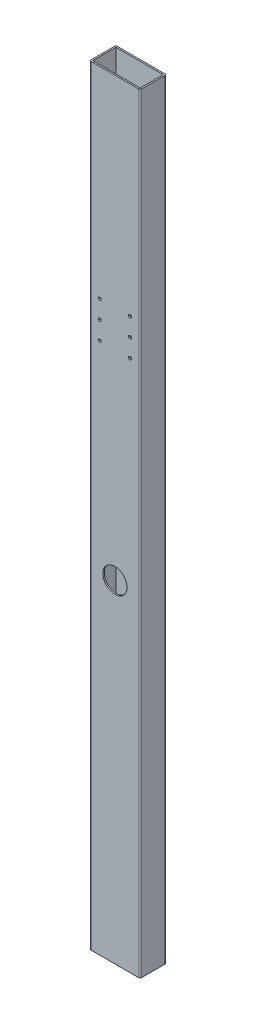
ISO-10303-21;
HEADER;
FILE_DESCRIPTION(('STEP AP214'),'2;1');
FILE_NAME('part.step','',(''),(''),'','','');
FILE_SCHEMA(('AUTOMOTIVE_DESIGN { 1 0 10303 214 1 1 1 1 }'));
ENDSEC;
DATA;
#1=APPLICATION_CONTEXT('core data for automotive mechanical design processes');
#2=APPLICATION_PROTOCOL_DEFINITION('international standard','automotive_design',2000,#1);
#3=PRODUCT_CONTEXT('',#1,'mechanical');
#4=PRODUCT('Part','Part','',(#3));
#5=PRODUCT_RELATED_PRODUCT_CATEGORY('part','',(#4));
#6=PRODUCT_DEFINITION_FORMATION('','',#4);
#7=PRODUCT_DEFINITION_CONTEXT('part definition',#1,'design');
#8=PRODUCT_DEFINITION('design','',#6,#7);
#9=PRODUCT_DEFINITION_SHAPE('','',#8);
#10=(LENGTH_UNIT() NAMED_UNIT(*) SI_UNIT(.MILLI.,.METRE.));
#11=(NAMED_UNIT(*) PLANE_ANGLE_UNIT() SI_UNIT($,.RADIAN.));
#12=(NAMED_UNIT(*) SI_UNIT($,.STERADIAN.) SOLID_ANGLE_UNIT());
#13=UNCERTAINTY_MEASURE_WITH_UNIT(LENGTH_MEASURE(1.E-05),#10,'distance_accuracy_value','');
#14=(GEOMETRIC_REPRESENTATION_CONTEXT(3) GLOBAL_UNCERTAINTY_ASSIGNED_CONTEXT((#13)) GLOBAL_UNIT_ASSIGNED_CONTEXT((#10,
#11,#12)) REPRESENTATION_CONTEXT('',''));
#15=CARTESIAN_POINT('',(0.,0.,0.));
#16=DIRECTION('',(0.,0.,1.));
#17=DIRECTION('',(1.,0.,0.));
#18=AXIS2_PLACEMENT_3D('',#15,#16,#17);
#19=CARTESIAN_POINT('',(-24.8285,0.,12.1285));
#20=DIRECTION('',(0.,1.,0.));
#21=DIRECTION('',(0.,0.,1.));
#22=AXIS2_PLACEMENT_3D('',#19,#20,#21);
#23=PLANE('',#22);
#24=CARTESIAN_POINT('',(-24.8285,0.,12.1285));
#25=DIRECTION('',(0.,1.,0.));
#26=DIRECTION('',(0.,0.,-1.));
#27=AXIS2_PLACEMENT_3D('',#24,#25,#26);
#28=CIRCLE('',#27,1.5875);
#29=CARTESIAN_POINT('',(-26.416,0.,12.1285));
#30=VERTEX_POINT('',#29);
#31=CARTESIAN_POINT('',(-24.8285,0.,13.716));
#32=VERTEX_POINT('',#31);
#33=EDGE_CURVE('E183',#30,#32,#28,.T.);
#34=ORIENTED_EDGE('',*,*,#33,.F.);
#35=DIRECTION('',(0.,0.,1.));
#36=VECTOR('',#35,1.);
#37=CARTESIAN_POINT('',(-26.416,0.,12.1285));
#38=LINE('',#37,#36);
#39=CARTESIAN_POINT('',(-26.416,0.,-12.1285));
#40=VERTEX_POINT('',#39);
#41=EDGE_CURVE('E107',#40,#30,#38,.T.);
#42=ORIENTED_EDGE('',*,*,#41,.F.);
#43=CARTESIAN_POINT('',(-24.8285,0.,-12.1285));
#44=DIRECTION('',(0.,1.,0.));
#45=DIRECTION('',(0.,0.,-1.));
#46=AXIS2_PLACEMENT_3D('',#43,#44,#45);
#47=CIRCLE('',#46,1.5875);
#48=CARTESIAN_POINT('',(-24.8285,0.,-13.716));
#49=VERTEX_POINT('',#48);
#50=EDGE_CURVE('E290',#49,#40,#47,.T.);
#51=ORIENTED_EDGE('',*,*,#50,.F.);
#52=DIRECTION('',(-1.,0.,0.));
#53=VECTOR('',#52,1.);
#54=CARTESIAN_POINT('',(-24.8285,0.,-13.716));
#55=LINE('',#54,#53);
#56=CARTESIAN_POINT('',(24.8285,0.,-13.716));
#57=VERTEX_POINT('',#56);
#58=EDGE_CURVE('E287',#57,#49,#55,.T.);
#59=ORIENTED_EDGE('',*,*,#58,.F.);
#60=CARTESIAN_POINT('',(24.8285,0.,-12.1285));
#61=DIRECTION('',(0.,1.,0.));
#62=DIRECTION('',(0.,0.,-1.));
#63=AXIS2_PLACEMENT_3D('',#60,#61,#62);
#64=CIRCLE('',#63,1.5875);
#65=CARTESIAN_POINT('',(26.416,0.,-12.1285));
#66=VERTEX_POINT('',#65);
#67=EDGE_CURVE('E284',#66,#57,#64,.T.);
#68=ORIENTED_EDGE('',*,*,#67,.F.);
#69=DIRECTION('',(0.,0.,-1.));
#70=VECTOR('',#69,1.);
#71=CARTESIAN_POINT('',(26.416,0.,12.1285));
#72=LINE('',#71,#70);
#73=CARTESIAN_POINT('',(26.416,0.,12.1285));
#74=VERTEX_POINT('',#73);
#75=EDGE_CURVE('E281',#74,#66,#72,.T.);
#76=ORIENTED_EDGE('',*,*,#75,.F.);
#77=CARTESIAN_POINT('',(24.8285,0.,12.1285));
#78=DIRECTION('',(0.,1.,0.));
#79=DIRECTION('',(0.,0.,1.));
#80=AXIS2_PLACEMENT_3D('',#77,#78,#79);
#81=CIRCLE('',#80,1.5875);
#82=CARTESIAN_POINT('',(24.8285,0.,13.716));
#83=VERTEX_POINT('',#82);
#84=EDGE_CURVE('E278',#83,#74,#81,.T.);
#85=ORIENTED_EDGE('',*,*,#84,.F.);
#86=DIRECTION('',(1.,0.,0.));
#87=VECTOR('',#86,1.);
#88=CARTESIAN_POINT('',(-24.8285,0.,13.716));
#89=LINE('',#88,#87);
#90=EDGE_CURVE('E275',#32,#83,#89,.T.);
#91=ORIENTED_EDGE('',*,*,#90,.F.);
#92=EDGE_LOOP('',(#34,#42,#51,#59,#68,#76,#85,#91));
#93=FACE_BOUND('',#92,.T.);
#94=DIRECTION('',(0.,0.,1.));
#95=VECTOR('',#94,1.);
#96=CARTESIAN_POINT('',(-24.8285,0.,12.1285));
#97=LINE('',#96,#95);
#98=CARTESIAN_POINT('',(-24.8285,0.,-12.1285));
#99=VERTEX_POINT('',#98);
#100=CARTESIAN_POINT('',(-24.8285,0.,12.1285));
#101=VERTEX_POINT('',#100);
#102=EDGE_CURVE('E99',#99,#101,#97,.T.);
#103=ORIENTED_EDGE('',*,*,#102,.T.);
#104=DIRECTION('',(1.,0.,0.));
#105=VECTOR('',#104,1.);
#106=CARTESIAN_POINT('',(-24.8285,0.,12.1285));
#107=LINE('',#106,#105);
#108=CARTESIAN_POINT('',(24.8285,0.,12.1285));
#109=VERTEX_POINT('',#108);
#110=EDGE_CURVE('E181',#101,#109,#107,.T.);
#111=ORIENTED_EDGE('',*,*,#110,.T.);
#112=DIRECTION('',(0.,0.,-1.));
#113=VECTOR('',#112,1.);
#114=CARTESIAN_POINT('',(24.8285,0.,12.1285));
#115=LINE('',#114,#113);
#116=CARTESIAN_POINT('',(24.8285,0.,-12.1285));
#117=VERTEX_POINT('',#116);
#118=EDGE_CURVE('E257',#109,#117,#115,.T.);
#119=ORIENTED_EDGE('',*,*,#118,.T.);
#120=DIRECTION('',(-1.,0.,0.));
#121=VECTOR('',#120,1.);
#122=CARTESIAN_POINT('',(-24.8285,0.,-12.1285));
#123=LINE('',#122,#121);
#124=EDGE_CURVE('E261',#117,#99,#123,.T.);
#125=ORIENTED_EDGE('',*,*,#124,.T.);
#126=EDGE_LOOP('',(#103,#111,#119,#125));
#127=FACE_BOUND('',#126,.T.);
#128=ADVANCED_FACE('F81',(#93,#127),#23,.F.);
#129=CARTESIAN_POINT('',(-24.8285,589.28,12.1285));
#130=DIRECTION('',(0.,-1.,0.));
#131=DIRECTION('',(0.,0.,-1.));
#132=AXIS2_PLACEMENT_3D('',#129,#130,#131);
#133=CYLINDRICAL_SURFACE('',#132,1.5875);
#134=ORIENTED_EDGE('',*,*,#33,.T.);
#135=DIRECTION('',(0.,-1.,0.));
#136=VECTOR('',#135,1.);
#137=CARTESIAN_POINT('',(-24.8285,589.28,13.716));
#138=LINE('',#137,#136);
#139=CARTESIAN_POINT('',(-24.8285,806.45,13.716));
#140=VERTEX_POINT('',#139);
#141=EDGE_CURVE('E12',#140,#32,#138,.T.);
#142=ORIENTED_EDGE('',*,*,#141,.F.);
#143=CARTESIAN_POINT('',(-24.8285,806.45,12.1285));
#144=DIRECTION('',(0.,1.,0.));
#145=DIRECTION('',(0.,0.,1.));
#146=AXIS2_PLACEMENT_3D('',#143,#144,#145);
#147=CIRCLE('',#146,1.5875);
#148=CARTESIAN_POINT('',(-26.416,806.45,12.1285));
#149=VERTEX_POINT('',#148);
#150=EDGE_CURVE('E208',#149,#140,#147,.T.);
#151=ORIENTED_EDGE('',*,*,#150,.F.);
#152=DIRECTION('',(0.,-1.,0.));
#153=VECTOR('',#152,1.);
#154=CARTESIAN_POINT('',(-26.416,589.28,12.1285));
#155=LINE('',#154,#153);
#156=EDGE_CURVE('E295',#149,#30,#155,.T.);
#157=ORIENTED_EDGE('',*,*,#156,.T.);
#158=EDGE_LOOP('',(#134,#142,#151,#157));
#159=FACE_BOUND('',#158,.T.);
#160=ADVANCED_FACE('F83',(#159),#133,.T.);
#161=CARTESIAN_POINT('',(-24.8285,589.28,13.716));
#162=DIRECTION('',(0.,0.,-1.));
#163=DIRECTION('',(-1.,0.,0.));
#164=AXIS2_PLACEMENT_3D('',#161,#162,#163);
#165=PLANE('',#164);
#166=CARTESIAN_POINT('',(-15.8749999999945,595.629999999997,13.716));
#167=DIRECTION('',(0.,0.,1.));
#168=DIRECTION('',(1.,0.,0.));
#169=AXIS2_PLACEMENT_3D('',#166,#167,#168);
#170=CIRCLE('',#169,1.58749999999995);
#171=CARTESIAN_POINT('',(-14.2874999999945,595.629999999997,13.716));
#172=VERTEX_POINT('',#171);
#173=EDGE_CURVE('E441',#172,#172,#170,.T.);
#174=ORIENTED_EDGE('',*,*,#173,.F.);
#175=EDGE_LOOP('',(#174));
#176=FACE_BOUND('',#175,.T.);
#177=CARTESIAN_POINT('',(-15.8749999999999,557.53,13.716));
#178=DIRECTION('',(0.,0.,1.));
#179=DIRECTION('',(1.,0.,0.));
#180=AXIS2_PLACEMENT_3D('',#177,#178,#179);
#181=CIRCLE('',#180,1.58749999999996);
#182=CARTESIAN_POINT('',(-14.2875,557.53,13.716));
#183=VERTEX_POINT('',#182);
#184=EDGE_CURVE('E445',#183,#183,#181,.T.);
#185=ORIENTED_EDGE('',*,*,#184,.F.);
#186=EDGE_LOOP('',(#185));
#187=FACE_BOUND('',#186,.T.);
#188=CARTESIAN_POINT('',(-15.875,576.58,13.716));
#189=DIRECTION('',(0.,0.,1.));
#190=DIRECTION('',(1.,0.,0.));
#191=AXIS2_PLACEMENT_3D('',#188,#189,#190);
#192=CIRCLE('',#191,1.58749999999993);
#193=CARTESIAN_POINT('',(-14.2875,576.58,13.716));
#194=VERTEX_POINT('',#193);
#195=EDGE_CURVE('E449',#194,#194,#192,.T.);
#196=ORIENTED_EDGE('',*,*,#195,.F.);
#197=EDGE_LOOP('',(#196));
#198=FACE_BOUND('',#197,.T.);
#199=CARTESIAN_POINT('',(15.8750000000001,557.53,13.716));
#200=DIRECTION('',(0.,0.,1.));
#201=DIRECTION('',(1.,0.,0.));
#202=AXIS2_PLACEMENT_3D('',#199,#200,#201);
#203=CIRCLE('',#202,1.5875000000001);
#204=CARTESIAN_POINT('',(17.4625000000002,557.53,13.716));
#205=VERTEX_POINT('',#204);
#206=EDGE_CURVE('E453',#205,#205,#203,.T.);
#207=ORIENTED_EDGE('',*,*,#206,.F.);
#208=EDGE_LOOP('',(#207));
#209=FACE_BOUND('',#208,.T.);
#210=CARTESIAN_POINT('',(15.8750000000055,595.629999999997,13.716));
#211=DIRECTION('',(0.,0.,1.));
#212=DIRECTION('',(1.,0.,0.));
#213=AXIS2_PLACEMENT_3D('',#210,#211,#212);
#214=CIRCLE('',#213,1.58750000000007);
#215=CARTESIAN_POINT('',(17.4625000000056,595.629999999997,13.716));
#216=VERTEX_POINT('',#215);
#217=EDGE_CURVE('E457',#216,#216,#214,.T.);
#218=ORIENTED_EDGE('',*,*,#217,.F.);
#219=EDGE_LOOP('',(#218));
#220=FACE_BOUND('',#219,.T.);
#221=CARTESIAN_POINT('',(15.875,576.58,13.716));
#222=DIRECTION('',(0.,0.,1.));
#223=DIRECTION('',(1.,0.,0.));
#224=AXIS2_PLACEMENT_3D('',#221,#222,#223);
#225=CIRCLE('',#224,1.58750000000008);
#226=CARTESIAN_POINT('',(17.4625000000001,576.58,13.716));
#227=VERTEX_POINT('',#226);
#228=EDGE_CURVE('E461',#227,#227,#225,.T.);
#229=ORIENTED_EDGE('',*,*,#228,.F.);
#230=EDGE_LOOP('',(#229));
#231=FACE_BOUND('',#230,.T.);
#232=CARTESIAN_POINT('',(0.,347.98,13.716));
#233=DIRECTION('',(0.,0.,1.));
#234=DIRECTION('',(1.,0.,0.));
#235=AXIS2_PLACEMENT_3D('',#232,#233,#234);
#236=CIRCLE('',#235,12.7);
#237=CARTESIAN_POINT('',(12.7,347.98,13.716));
#238=VERTEX_POINT('',#237);
#239=EDGE_CURVE('E240',#238,#238,#236,.T.);
#240=ORIENTED_EDGE('',*,*,#239,.F.);
#241=EDGE_LOOP('',(#240));
#242=FACE_BOUND('',#241,.T.);
#243=ORIENTED_EDGE('',*,*,#90,.T.);
#244=DIRECTION('',(0.,-1.,0.));
#245=VECTOR('',#244,1.);
#246=CARTESIAN_POINT('',(24.8285,589.28,13.716));
#247=LINE('',#246,#245);
#248=CARTESIAN_POINT('',(24.8285,806.45,13.716));
#249=VERTEX_POINT('',#248);
#250=EDGE_CURVE('E91',#249,#83,#247,.T.);
#251=ORIENTED_EDGE('',*,*,#250,.F.);
#252=DIRECTION('',(1.,0.,0.));
#253=VECTOR('',#252,1.);
#254=CARTESIAN_POINT('',(-24.8285,806.45,13.716));
#255=LINE('',#254,#253);
#256=EDGE_CURVE('E212',#140,#249,#255,.T.);
#257=ORIENTED_EDGE('',*,*,#256,.F.);
#258=ORIENTED_EDGE('',*,*,#141,.T.);
#259=EDGE_LOOP('',(#243,#251,#257,#258));
#260=FACE_BOUND('',#259,.T.);
#261=ADVANCED_FACE('F407',(#176,#187,#198,#209,#220,#231,#242,#260),#165,.F.);
#262=CARTESIAN_POINT('',(24.8285,589.28,12.1285));
#263=DIRECTION('',(0.,-1.,0.));
#264=DIRECTION('',(0.,0.,-1.));
#265=AXIS2_PLACEMENT_3D('',#262,#263,#264);
#266=CYLINDRICAL_SURFACE('',#265,1.5875);
#267=ORIENTED_EDGE('',*,*,#84,.T.);
#268=DIRECTION('',(0.,-1.,0.));
#269=VECTOR('',#268,1.);
#270=CARTESIAN_POINT('',(26.416,589.28,12.1285));
#271=LINE('',#270,#269);
#272=CARTESIAN_POINT('',(26.416,806.45,12.1285));
#273=VERTEX_POINT('',#272);
#274=EDGE_CURVE('E313',#273,#74,#271,.T.);
#275=ORIENTED_EDGE('',*,*,#274,.F.);
#276=CARTESIAN_POINT('',(24.8285,806.45,12.1285));
#277=DIRECTION('',(0.,1.,0.));
#278=DIRECTION('',(0.,0.,1.));
#279=AXIS2_PLACEMENT_3D('',#276,#277,#278);
#280=CIRCLE('',#279,1.5875);
#281=EDGE_CURVE('E216',#249,#273,#280,.T.);
#282=ORIENTED_EDGE('',*,*,#281,.F.);
#283=ORIENTED_EDGE('',*,*,#250,.T.);
#284=EDGE_LOOP('',(#267,#275,#282,#283));
#285=FACE_BOUND('',#284,.T.);
#286=ADVANCED_FACE('F430',(#285),#266,.T.);
#287=CARTESIAN_POINT('',(26.416,589.28,12.1285));
#288=DIRECTION('',(-1.,0.,0.));
#289=DIRECTION('',(0.,0.,1.));
#290=AXIS2_PLACEMENT_3D('',#287,#288,#289);
#291=PLANE('',#290);
#292=ORIENTED_EDGE('',*,*,#75,.T.);
#293=DIRECTION('',(0.,-1.,0.));
#294=VECTOR('',#293,1.);
#295=CARTESIAN_POINT('',(26.416,589.28,-12.1285));
#296=LINE('',#295,#294);
#297=CARTESIAN_POINT('',(26.416,806.45,-12.1285));
#298=VERTEX_POINT('',#297);
#299=EDGE_CURVE('E309',#298,#66,#296,.T.);
#300=ORIENTED_EDGE('',*,*,#299,.F.);
#301=DIRECTION('',(0.,0.,-1.));
#302=VECTOR('',#301,1.);
#303=CARTESIAN_POINT('',(26.416,806.45,12.1285));
#304=LINE('',#303,#302);
#305=EDGE_CURVE('E220',#273,#298,#304,.T.);
#306=ORIENTED_EDGE('',*,*,#305,.F.);
#307=ORIENTED_EDGE('',*,*,#274,.T.);
#308=EDGE_LOOP('',(#292,#300,#306,#307));
#309=FACE_BOUND('',#308,.T.);
#310=ADVANCED_FACE('F426',(#309),#291,.F.);
#311=CARTESIAN_POINT('',(24.8285,589.28,-12.1285));
#312=DIRECTION('',(0.,-1.,0.));
#313=DIRECTION('',(0.,0.,-1.));
#314=AXIS2_PLACEMENT_3D('',#311,#312,#313);
#315=CYLINDRICAL_SURFACE('',#314,1.5875);
#316=ORIENTED_EDGE('',*,*,#67,.T.);
#317=DIRECTION('',(0.,-1.,0.));
#318=VECTOR('',#317,1.);
#319=CARTESIAN_POINT('',(24.8285,589.28,-13.716));
#320=LINE('',#319,#318);
#321=CARTESIAN_POINT('',(24.8285,806.45,-13.716));
#322=VERTEX_POINT('',#321);
#323=EDGE_CURVE('E305',#322,#57,#320,.T.);
#324=ORIENTED_EDGE('',*,*,#323,.F.);
#325=CARTESIAN_POINT('',(24.8285,806.45,-12.1285));
#326=DIRECTION('',(0.,1.,0.));
#327=DIRECTION('',(0.,0.,1.));
#328=AXIS2_PLACEMENT_3D('',#325,#326,#327);
#329=CIRCLE('',#328,1.5875);
#330=EDGE_CURVE('E224',#298,#322,#329,.T.);
#331=ORIENTED_EDGE('',*,*,#330,.F.);
#332=ORIENTED_EDGE('',*,*,#299,.T.);
#333=EDGE_LOOP('',(#316,#324,#331,#332));
#334=FACE_BOUND('',#333,.T.);
#335=ADVANCED_FACE('F422',(#334),#315,.T.);
#336=CARTESIAN_POINT('',(-24.8285,589.28,-13.716));
#337=DIRECTION('',(0.,0.,1.));
#338=DIRECTION('',(1.,0.,0.));
#339=AXIS2_PLACEMENT_3D('',#336,#337,#338);
#340=PLANE('',#339);
#341=CARTESIAN_POINT('',(-15.8749999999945,595.629999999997,-13.716));
#342=DIRECTION('',(0.,0.,1.));
#343=DIRECTION('',(1.,0.,0.));
#344=AXIS2_PLACEMENT_3D('',#341,#342,#343);
#345=CIRCLE('',#344,1.58749999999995);
#346=CARTESIAN_POINT('',(-14.2874999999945,595.629999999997,-13.716));
#347=VERTEX_POINT('',#346);
#348=EDGE_CURVE('E677',#347,#347,#345,.T.);
#349=ORIENTED_EDGE('',*,*,#348,.T.);
#350=EDGE_LOOP('',(#349));
#351=FACE_BOUND('',#350,.T.);
#352=CARTESIAN_POINT('',(-15.8749999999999,557.53,-13.716));
#353=DIRECTION('',(0.,0.,1.));
#354=DIRECTION('',(1.,0.,0.));
#355=AXIS2_PLACEMENT_3D('',#352,#353,#354);
#356=CIRCLE('',#355,1.58749999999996);
#357=CARTESIAN_POINT('',(-14.2875,557.53,-13.716));
#358=VERTEX_POINT('',#357);
#359=EDGE_CURVE('E676',#358,#358,#356,.T.);
#360=ORIENTED_EDGE('',*,*,#359,.T.);
#361=EDGE_LOOP('',(#360));
#362=FACE_BOUND('',#361,.T.);
#363=CARTESIAN_POINT('',(-15.875,576.58,-13.716));
#364=DIRECTION('',(0.,0.,1.));
#365=DIRECTION('',(1.,0.,0.));
#366=AXIS2_PLACEMENT_3D('',#363,#364,#365);
#367=CIRCLE('',#366,1.58749999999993);
#368=CARTESIAN_POINT('',(-14.2875,576.58,-13.716));
#369=VERTEX_POINT('',#368);
#370=EDGE_CURVE('E695',#369,#369,#367,.T.);
#371=ORIENTED_EDGE('',*,*,#370,.T.);
#372=EDGE_LOOP('',(#371));
#373=FACE_BOUND('',#372,.T.);
#374=CARTESIAN_POINT('',(15.8750000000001,557.53,-13.716));
#375=DIRECTION('',(0.,0.,1.));
#376=DIRECTION('',(1.,0.,0.));
#377=AXIS2_PLACEMENT_3D('',#374,#375,#376);
#378=CIRCLE('',#377,1.5875000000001);
#379=CARTESIAN_POINT('',(17.4625000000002,557.53,-13.716));
#380=VERTEX_POINT('',#379);
#381=EDGE_CURVE('E689',#380,#380,#378,.T.);
#382=ORIENTED_EDGE('',*,*,#381,.T.);
#383=EDGE_LOOP('',(#382));
#384=FACE_BOUND('',#383,.T.);
#385=CARTESIAN_POINT('',(15.8750000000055,595.629999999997,-13.716));
#386=DIRECTION('',(0.,0.,1.));
#387=DIRECTION('',(1.,0.,0.));
#388=AXIS2_PLACEMENT_3D('',#385,#386,#387);
#389=CIRCLE('',#388,1.58750000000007);
#390=CARTESIAN_POINT('',(17.4625000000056,595.629999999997,-13.716));
#391=VERTEX_POINT('',#390);
#392=EDGE_CURVE('E718',#391,#391,#389,.T.);
#393=ORIENTED_EDGE('',*,*,#392,.T.);
#394=EDGE_LOOP('',(#393));
#395=FACE_BOUND('',#394,.T.);
#396=CARTESIAN_POINT('',(15.875,576.58,-13.716));
#397=DIRECTION('',(0.,0.,1.));
#398=DIRECTION('',(1.,0.,0.));
#399=AXIS2_PLACEMENT_3D('',#396,#397,#398);
#400=CIRCLE('',#399,1.58750000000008);
#401=CARTESIAN_POINT('',(17.4625000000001,576.58,-13.716));
#402=VERTEX_POINT('',#401);
#403=EDGE_CURVE('E328',#402,#402,#400,.T.);
#404=ORIENTED_EDGE('',*,*,#403,.T.);
#405=EDGE_LOOP('',(#404));
#406=FACE_BOUND('',#405,.T.);
#407=CARTESIAN_POINT('',(0.,347.98,-13.716));
#408=DIRECTION('',(0.,0.,1.));
#409=DIRECTION('',(1.,0.,0.));
#410=AXIS2_PLACEMENT_3D('',#407,#408,#409);
#411=CIRCLE('',#410,12.7);
#412=CARTESIAN_POINT('',(12.7,347.98,-13.716));
#413=VERTEX_POINT('',#412);
#414=EDGE_CURVE('E241',#413,#413,#411,.T.);
#415=ORIENTED_EDGE('',*,*,#414,.T.);
#416=EDGE_LOOP('',(#415));
#417=FACE_BOUND('',#416,.T.);
#418=ORIENTED_EDGE('',*,*,#58,.T.);
#419=DIRECTION('',(0.,-1.,0.));
#420=VECTOR('',#419,1.);
#421=CARTESIAN_POINT('',(-24.8285,589.28,-13.716));
#422=LINE('',#421,#420);
#423=CARTESIAN_POINT('',(-24.8285,806.45,-13.716));
#424=VERTEX_POINT('',#423);
#425=EDGE_CURVE('E301',#424,#49,#422,.T.);
#426=ORIENTED_EDGE('',*,*,#425,.F.);
#427=DIRECTION('',(-1.,0.,0.));
#428=VECTOR('',#427,1.);
#429=CARTESIAN_POINT('',(24.8285,806.45,-13.716));
#430=LINE('',#429,#428);
#431=EDGE_CURVE('E228',#322,#424,#430,.T.);
#432=ORIENTED_EDGE('',*,*,#431,.F.);
#433=ORIENTED_EDGE('',*,*,#323,.T.);
#434=EDGE_LOOP('',(#418,#426,#432,#433));
#435=FACE_BOUND('',#434,.T.);
#436=ADVANCED_FACE('F418',(#351,#362,#373,#384,#395,#406,#417,#435),#340,.F.);
#437=CARTESIAN_POINT('',(-24.8285,589.28,-12.1285));
#438=DIRECTION('',(0.,-1.,0.));
#439=DIRECTION('',(0.,0.,-1.));
#440=AXIS2_PLACEMENT_3D('',#437,#438,#439);
#441=CYLINDRICAL_SURFACE('',#440,1.5875);
#442=ORIENTED_EDGE('',*,*,#50,.T.);
#443=DIRECTION('',(0.,-1.,0.));
#444=VECTOR('',#443,1.);
#445=CARTESIAN_POINT('',(-26.416,589.28,-12.1285));
#446=LINE('',#445,#444);
#447=CARTESIAN_POINT('',(-26.416,806.45,-12.1285));
#448=VERTEX_POINT('',#447);
#449=EDGE_CURVE('E298',#448,#40,#446,.T.);
#450=ORIENTED_EDGE('',*,*,#449,.F.);
#451=CARTESIAN_POINT('',(-24.8285,806.45,-12.1285));
#452=DIRECTION('',(0.,1.,0.));
#453=DIRECTION('',(0.,0.,1.));
#454=AXIS2_PLACEMENT_3D('',#451,#452,#453);
#455=CIRCLE('',#454,1.5875);
#456=EDGE_CURVE('E232',#424,#448,#455,.T.);
#457=ORIENTED_EDGE('',*,*,#456,.F.);
#458=ORIENTED_EDGE('',*,*,#425,.T.);
#459=EDGE_LOOP('',(#442,#450,#457,#458));
#460=FACE_BOUND('',#459,.T.);
#461=ADVANCED_FACE('F415',(#460),#441,.T.);
#462=CARTESIAN_POINT('',(-26.416,589.28,12.1285));
#463=DIRECTION('',(1.,0.,0.));
#464=DIRECTION('',(0.,0.,-1.));
#465=AXIS2_PLACEMENT_3D('',#462,#463,#464);
#466=PLANE('',#465);
#467=ORIENTED_EDGE('',*,*,#41,.T.);
#468=ORIENTED_EDGE('',*,*,#156,.F.);
#469=DIRECTION('',(0.,0.,1.));
#470=VECTOR('',#469,1.);
#471=CARTESIAN_POINT('',(-26.416,806.45,-12.1285));
#472=LINE('',#471,#470);
#473=EDGE_CURVE('E236',#448,#149,#472,.T.);
#474=ORIENTED_EDGE('',*,*,#473,.F.);
#475=ORIENTED_EDGE('',*,*,#449,.T.);
#476=EDGE_LOOP('',(#467,#468,#474,#475));
#477=FACE_BOUND('',#476,.T.);
#478=ADVANCED_FACE('F412',(#477),#466,.F.);
#479=CARTESIAN_POINT('',(-24.8285,589.28,12.1285));
#480=DIRECTION('',(1.,0.,0.));
#481=DIRECTION('',(0.,0.,-1.));
#482=AXIS2_PLACEMENT_3D('',#479,#480,#481);
#483=PLANE('',#482);
#484=ORIENTED_EDGE('',*,*,#102,.F.);
#485=DIRECTION('',(0.,-1.,0.));
#486=VECTOR('',#485,1.);
#487=CARTESIAN_POINT('',(-24.8285,589.28,-12.1285));
#488=LINE('',#487,#486);
#489=CARTESIAN_POINT('',(-24.8285,806.45,-12.1285));
#490=VERTEX_POINT('',#489);
#491=EDGE_CURVE('E189',#490,#99,#488,.T.);
#492=ORIENTED_EDGE('',*,*,#491,.F.);
#493=DIRECTION('',(0.,0.,1.));
#494=VECTOR('',#493,1.);
#495=CARTESIAN_POINT('',(-24.8285,806.45,-12.1285));
#496=LINE('',#495,#494);
#497=CARTESIAN_POINT('',(-24.8285,806.45,12.1285));
#498=VERTEX_POINT('',#497);
#499=EDGE_CURVE('E187',#490,#498,#496,.T.);
#500=ORIENTED_EDGE('',*,*,#499,.T.);
#501=DIRECTION('',(0.,-1.,0.));
#502=VECTOR('',#501,1.);
#503=CARTESIAN_POINT('',(-24.8285,589.28,12.1285));
#504=LINE('',#503,#502);
#505=EDGE_CURVE('E174',#498,#101,#504,.T.);
#506=ORIENTED_EDGE('',*,*,#505,.T.);
#507=EDGE_LOOP('',(#484,#492,#500,#506));
#508=FACE_BOUND('',#507,.T.);
#509=ADVANCED_FACE('F188',(#508),#483,.T.);
#510=CARTESIAN_POINT('',(-24.8285,589.28,12.1285));
#511=DIRECTION('',(0.,0.,-1.));
#512=DIRECTION('',(-1.,0.,0.));
#513=AXIS2_PLACEMENT_3D('',#510,#511,#512);
#514=PLANE('',#513);
#515=CARTESIAN_POINT('',(-15.8749999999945,595.629999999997,12.1285));
#516=DIRECTION('',(0.,0.,-1.));
#517=DIRECTION('',(-1.,0.,0.));
#518=AXIS2_PLACEMENT_3D('',#515,#516,#517);
#519=CIRCLE('',#518,1.58749999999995);
#520=CARTESIAN_POINT('',(-17.4624999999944,595.629999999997,12.1285));
#521=VERTEX_POINT('',#520);
#522=EDGE_CURVE('E194',#521,#521,#519,.T.);
#523=ORIENTED_EDGE('',*,*,#522,.F.);
#524=EDGE_LOOP('',(#523));
#525=FACE_BOUND('',#524,.T.);
#526=CARTESIAN_POINT('',(-15.8749999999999,557.53,12.1285));
#527=DIRECTION('',(0.,0.,-1.));
#528=DIRECTION('',(-1.,0.,0.));
#529=AXIS2_PLACEMENT_3D('',#526,#527,#528);
#530=CIRCLE('',#529,1.58749999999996);
#531=CARTESIAN_POINT('',(-17.4624999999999,557.53,12.1285));
#532=VERTEX_POINT('',#531);
#533=EDGE_CURVE('E346',#532,#532,#530,.T.);
#534=ORIENTED_EDGE('',*,*,#533,.F.);
#535=EDGE_LOOP('',(#534));
#536=FACE_BOUND('',#535,.T.);
#537=CARTESIAN_POINT('',(-15.875,576.58,12.1285));
#538=DIRECTION('',(0.,0.,-1.));
#539=DIRECTION('',(-1.,0.,0.));
#540=AXIS2_PLACEMENT_3D('',#537,#538,#539);
#541=CIRCLE('',#540,1.58749999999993);
#542=CARTESIAN_POINT('',(-17.4624999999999,576.58,12.1285));
#543=VERTEX_POINT('',#542);
#544=EDGE_CURVE('E342',#543,#543,#541,.T.);
#545=ORIENTED_EDGE('',*,*,#544,.F.);
#546=EDGE_LOOP('',(#545));
#547=FACE_BOUND('',#546,.T.);
#548=CARTESIAN_POINT('',(15.8750000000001,557.53,12.1285));
#549=DIRECTION('',(0.,0.,-1.));
#550=DIRECTION('',(-1.,0.,0.));
#551=AXIS2_PLACEMENT_3D('',#548,#549,#550);
#552=CIRCLE('',#551,1.5875000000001);
#553=CARTESIAN_POINT('',(14.2875,557.53,12.1285));
#554=VERTEX_POINT('',#553);
#555=EDGE_CURVE('E338',#554,#554,#552,.T.);
#556=ORIENTED_EDGE('',*,*,#555,.F.);
#557=EDGE_LOOP('',(#556));
#558=FACE_BOUND('',#557,.T.);
#559=CARTESIAN_POINT('',(15.8750000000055,595.629999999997,12.1285));
#560=DIRECTION('',(0.,0.,-1.));
#561=DIRECTION('',(-1.,0.,0.));
#562=AXIS2_PLACEMENT_3D('',#559,#560,#561);
#563=CIRCLE('',#562,1.58750000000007);
#564=CARTESIAN_POINT('',(14.2875000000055,595.629999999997,12.1285));
#565=VERTEX_POINT('',#564);
#566=EDGE_CURVE('E333',#565,#565,#563,.T.);
#567=ORIENTED_EDGE('',*,*,#566,.F.);
#568=EDGE_LOOP('',(#567));
#569=FACE_BOUND('',#568,.T.);
#570=CARTESIAN_POINT('',(15.875,576.58,12.1285));
#571=DIRECTION('',(0.,0.,-1.));
#572=DIRECTION('',(-1.,0.,0.));
#573=AXIS2_PLACEMENT_3D('',#570,#571,#572);
#574=CIRCLE('',#573,1.58750000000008);
#575=CARTESIAN_POINT('',(14.2875,576.58,12.1285));
#576=VERTEX_POINT('',#575);
#577=EDGE_CURVE('E327',#576,#576,#574,.T.);
#578=ORIENTED_EDGE('',*,*,#577,.F.);
#579=EDGE_LOOP('',(#578));
#580=FACE_BOUND('',#579,.T.);
#581=CARTESIAN_POINT('',(0.,347.98,12.1285));
#582=DIRECTION('',(0.,0.,-1.));
#583=DIRECTION('',(-1.,0.,0.));
#584=AXIS2_PLACEMENT_3D('',#581,#582,#583);
#585=CIRCLE('',#584,12.7);
#586=CARTESIAN_POINT('',(-12.7,347.98,12.1285));
#587=VERTEX_POINT('',#586);
#588=EDGE_CURVE('E249',#587,#587,#585,.T.);
#589=ORIENTED_EDGE('',*,*,#588,.F.);
#590=EDGE_LOOP('',(#589));
#591=FACE_BOUND('',#590,.T.);
#592=ORIENTED_EDGE('',*,*,#110,.F.);
#593=ORIENTED_EDGE('',*,*,#505,.F.);
#594=DIRECTION('',(1.,0.,0.));
#595=VECTOR('',#594,1.);
#596=CARTESIAN_POINT('',(-24.8285,806.45,12.1285));
#597=LINE('',#596,#595);
#598=CARTESIAN_POINT('',(24.8285,806.45,12.1285));
#599=VERTEX_POINT('',#598);
#600=EDGE_CURVE('E178',#498,#599,#597,.T.);
#601=ORIENTED_EDGE('',*,*,#600,.T.);
#602=DIRECTION('',(0.,-1.,0.));
#603=VECTOR('',#602,1.);
#604=CARTESIAN_POINT('',(24.8285,589.28,12.1285));
#605=LINE('',#604,#603);
#606=EDGE_CURVE('E184',#599,#109,#605,.T.);
#607=ORIENTED_EDGE('',*,*,#606,.T.);
#608=EDGE_LOOP('',(#592,#593,#601,#607));
#609=FACE_BOUND('',#608,.T.);
#610=ADVANCED_FACE('F176',(#525,#536,#547,#558,#569,#580,#591,#609),#514,.T.);
#611=CARTESIAN_POINT('',(24.8285,589.28,12.1285));
#612=DIRECTION('',(-1.,0.,0.));
#613=DIRECTION('',(0.,0.,1.));
#614=AXIS2_PLACEMENT_3D('',#611,#612,#613);
#615=PLANE('',#614);
#616=ORIENTED_EDGE('',*,*,#118,.F.);
#617=ORIENTED_EDGE('',*,*,#606,.F.);
#618=DIRECTION('',(0.,0.,-1.));
#619=VECTOR('',#618,1.);
#620=CARTESIAN_POINT('',(24.8285,806.45,12.1285));
#621=LINE('',#620,#619);
#622=CARTESIAN_POINT('',(24.8285,806.45,-12.1285));
#623=VERTEX_POINT('',#622);
#624=EDGE_CURVE('E198',#599,#623,#621,.T.);
#625=ORIENTED_EDGE('',*,*,#624,.T.);
#626=DIRECTION('',(0.,-1.,0.));
#627=VECTOR('',#626,1.);
#628=CARTESIAN_POINT('',(24.8285,589.28,-12.1285));
#629=LINE('',#628,#627);
#630=EDGE_CURVE('E267',#623,#117,#629,.T.);
#631=ORIENTED_EDGE('',*,*,#630,.T.);
#632=EDGE_LOOP('',(#616,#617,#625,#631));
#633=FACE_BOUND('',#632,.T.);
#634=ADVANCED_FACE('F374',(#633),#615,.T.);
#635=CARTESIAN_POINT('',(-24.8285,589.28,-12.1285));
#636=DIRECTION('',(0.,0.,1.));
#637=DIRECTION('',(1.,0.,0.));
#638=AXIS2_PLACEMENT_3D('',#635,#636,#637);
#639=PLANE('',#638);
#640=CARTESIAN_POINT('',(-15.8749999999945,595.629999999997,-12.1285));
#641=DIRECTION('',(0.,0.,1.));
#642=DIRECTION('',(1.,0.,0.));
#643=AXIS2_PLACEMENT_3D('',#640,#641,#642);
#644=CIRCLE('',#643,1.58749999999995);
#645=CARTESIAN_POINT('',(-14.2874999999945,595.629999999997,-12.1285));
#646=VERTEX_POINT('',#645);
#647=EDGE_CURVE('E85',#646,#646,#644,.T.);
#648=ORIENTED_EDGE('',*,*,#647,.F.);
#649=EDGE_LOOP('',(#648));
#650=FACE_BOUND('',#649,.T.);
#651=CARTESIAN_POINT('',(-15.8749999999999,557.53,-12.1285));
#652=DIRECTION('',(0.,0.,1.));
#653=DIRECTION('',(1.,0.,0.));
#654=AXIS2_PLACEMENT_3D('',#651,#652,#653);
#655=CIRCLE('',#654,1.58749999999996);
#656=CARTESIAN_POINT('',(-14.2875,557.53,-12.1285));
#657=VERTEX_POINT('',#656);
#658=EDGE_CURVE('E343',#657,#657,#655,.T.);
#659=ORIENTED_EDGE('',*,*,#658,.F.);
#660=EDGE_LOOP('',(#659));
#661=FACE_BOUND('',#660,.T.);
#662=CARTESIAN_POINT('',(-15.875,576.58,-12.1285));
#663=DIRECTION('',(0.,0.,1.));
#664=DIRECTION('',(1.,0.,0.));
#665=AXIS2_PLACEMENT_3D('',#662,#663,#664);
#666=CIRCLE('',#665,1.58749999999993);
#667=CARTESIAN_POINT('',(-14.2875,576.58,-12.1285));
#668=VERTEX_POINT('',#667);
#669=EDGE_CURVE('E339',#668,#668,#666,.T.);
#670=ORIENTED_EDGE('',*,*,#669,.F.);
#671=EDGE_LOOP('',(#670));
#672=FACE_BOUND('',#671,.T.);
#673=CARTESIAN_POINT('',(15.8750000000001,557.53,-12.1285));
#674=DIRECTION('',(0.,0.,1.));
#675=DIRECTION('',(1.,0.,0.));
#676=AXIS2_PLACEMENT_3D('',#673,#674,#675);
#677=CIRCLE('',#676,1.5875000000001);
#678=CARTESIAN_POINT('',(17.4625000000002,557.53,-12.1285));
#679=VERTEX_POINT('',#678);
#680=EDGE_CURVE('E334',#679,#679,#677,.T.);
#681=ORIENTED_EDGE('',*,*,#680,.F.);
#682=EDGE_LOOP('',(#681));
#683=FACE_BOUND('',#682,.T.);
#684=CARTESIAN_POINT('',(15.8750000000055,595.629999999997,-12.1285));
#685=DIRECTION('',(0.,0.,1.));
#686=DIRECTION('',(1.,0.,0.));
#687=AXIS2_PLACEMENT_3D('',#684,#685,#686);
#688=CIRCLE('',#687,1.58750000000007);
#689=CARTESIAN_POINT('',(17.4625000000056,595.629999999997,-12.1285));
#690=VERTEX_POINT('',#689);
#691=EDGE_CURVE('E329',#690,#690,#688,.T.);
#692=ORIENTED_EDGE('',*,*,#691,.F.);
#693=EDGE_LOOP('',(#692));
#694=FACE_BOUND('',#693,.T.);
#695=CARTESIAN_POINT('',(15.875,576.58,-12.1285));
#696=DIRECTION('',(0.,0.,1.));
#697=DIRECTION('',(1.,0.,0.));
#698=AXIS2_PLACEMENT_3D('',#695,#696,#697);
#699=CIRCLE('',#698,1.58750000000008);
#700=CARTESIAN_POINT('',(17.4625000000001,576.58,-12.1285));
#701=VERTEX_POINT('',#700);
#702=EDGE_CURVE('E323',#701,#701,#699,.T.);
#703=ORIENTED_EDGE('',*,*,#702,.F.);
#704=EDGE_LOOP('',(#703));
#705=FACE_BOUND('',#704,.T.);
#706=CARTESIAN_POINT('',(0.,347.98,-12.1285));
#707=DIRECTION('',(0.,0.,1.));
#708=DIRECTION('',(1.,0.,0.));
#709=AXIS2_PLACEMENT_3D('',#706,#707,#708);
#710=CIRCLE('',#709,12.7);
#711=CARTESIAN_POINT('',(12.7,347.98,-12.1285));
#712=VERTEX_POINT('',#711);
#713=EDGE_CURVE('E245',#712,#712,#710,.T.);
#714=ORIENTED_EDGE('',*,*,#713,.F.);
#715=EDGE_LOOP('',(#714));
#716=FACE_BOUND('',#715,.T.);
#717=ORIENTED_EDGE('',*,*,#124,.F.);
#718=ORIENTED_EDGE('',*,*,#630,.F.);
#719=DIRECTION('',(-1.,0.,0.));
#720=VECTOR('',#719,1.);
#721=CARTESIAN_POINT('',(24.8285,806.45,-12.1285));
#722=LINE('',#721,#720);
#723=EDGE_CURVE('E202',#623,#490,#722,.T.);
#724=ORIENTED_EDGE('',*,*,#723,.T.);
#725=ORIENTED_EDGE('',*,*,#491,.T.);
#726=EDGE_LOOP('',(#717,#718,#724,#725));
#727=FACE_BOUND('',#726,.T.);
#728=ADVANCED_FACE('F370',(#650,#661,#672,#683,#694,#705,#716,#727),#639,.T.);
#729=CARTESIAN_POINT('',(0.,347.98,-13.716));
#730=DIRECTION('',(0.,0.,1.));
#731=DIRECTION('',(1.,0.,0.));
#732=AXIS2_PLACEMENT_3D('',#729,#730,#731);
#733=CYLINDRICAL_SURFACE('',#732,12.7);
#734=ORIENTED_EDGE('',*,*,#713,.T.);
#735=EDGE_LOOP('',(#734));
#736=FACE_BOUND('',#735,.T.);
#737=ORIENTED_EDGE('',*,*,#414,.F.);
#738=EDGE_LOOP('',(#737));
#739=FACE_BOUND('',#738,.T.);
#740=ADVANCED_FACE('F373',(#736,#739),#733,.F.);
#741=ORIENTED_EDGE('',*,*,#588,.T.);
#742=EDGE_LOOP('',(#741));
#743=FACE_BOUND('',#742,.T.);
#744=ORIENTED_EDGE('',*,*,#239,.T.);
#745=EDGE_LOOP('',(#744));
#746=FACE_BOUND('',#745,.T.);
#747=ADVANCED_FACE('F480',(#743,#746),#733,.F.);
#748=CARTESIAN_POINT('',(-24.8285,806.45,12.1285));
#749=DIRECTION('',(0.,1.,0.));
#750=DIRECTION('',(0.,0.,1.));
#751=AXIS2_PLACEMENT_3D('',#748,#749,#750);
#752=PLANE('',#751);
#753=ORIENTED_EDGE('',*,*,#150,.T.);
#754=ORIENTED_EDGE('',*,*,#256,.T.);
#755=ORIENTED_EDGE('',*,*,#281,.T.);
#756=ORIENTED_EDGE('',*,*,#305,.T.);
#757=ORIENTED_EDGE('',*,*,#330,.T.);
#758=ORIENTED_EDGE('',*,*,#431,.T.);
#759=ORIENTED_EDGE('',*,*,#456,.T.);
#760=ORIENTED_EDGE('',*,*,#473,.T.);
#761=EDGE_LOOP('',(#753,#754,#755,#756,#757,#758,#759,#760));
#762=FACE_BOUND('',#761,.T.);
#763=ORIENTED_EDGE('',*,*,#600,.F.);
#764=ORIENTED_EDGE('',*,*,#499,.F.);
#765=ORIENTED_EDGE('',*,*,#723,.F.);
#766=ORIENTED_EDGE('',*,*,#624,.F.);
#767=EDGE_LOOP('',(#763,#764,#765,#766));
#768=FACE_BOUND('',#767,.T.);
#769=ADVANCED_FACE('F196',(#762,#768),#752,.T.);
#770=CARTESIAN_POINT('',(15.875,576.58,-13.716));
#771=DIRECTION('',(0.,0.,1.));
#772=DIRECTION('',(1.,0.,0.));
#773=AXIS2_PLACEMENT_3D('',#770,#771,#772);
#774=CYLINDRICAL_SURFACE('',#773,1.58750000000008);
#775=ORIENTED_EDGE('',*,*,#702,.T.);
#776=EDGE_LOOP('',(#775));
#777=FACE_BOUND('',#776,.T.);
#778=ORIENTED_EDGE('',*,*,#403,.F.);
#779=EDGE_LOOP('',(#778));
#780=FACE_BOUND('',#779,.T.);
#781=ADVANCED_FACE('F479',(#777,#780),#774,.F.);
#782=CARTESIAN_POINT('',(15.8750000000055,595.629999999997,-13.716));
#783=DIRECTION('',(0.,0.,1.));
#784=DIRECTION('',(1.,0.,0.));
#785=AXIS2_PLACEMENT_3D('',#782,#783,#784);
#786=CYLINDRICAL_SURFACE('',#785,1.58750000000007);
#787=ORIENTED_EDGE('',*,*,#691,.T.);
#788=EDGE_LOOP('',(#787));
#789=FACE_BOUND('',#788,.T.);
#790=ORIENTED_EDGE('',*,*,#392,.F.);
#791=EDGE_LOOP('',(#790));
#792=FACE_BOUND('',#791,.T.);
#793=ADVANCED_FACE('F485',(#789,#792),#786,.F.);
#794=CARTESIAN_POINT('',(15.8750000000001,557.53,-13.716));
#795=DIRECTION('',(0.,0.,1.));
#796=DIRECTION('',(1.,0.,0.));
#797=AXIS2_PLACEMENT_3D('',#794,#795,#796);
#798=CYLINDRICAL_SURFACE('',#797,1.5875000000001);
#799=ORIENTED_EDGE('',*,*,#680,.T.);
#800=EDGE_LOOP('',(#799));
#801=FACE_BOUND('',#800,.T.);
#802=ORIENTED_EDGE('',*,*,#381,.F.);
#803=EDGE_LOOP('',(#802));
#804=FACE_BOUND('',#803,.T.);
#805=ADVANCED_FACE('F584',(#801,#804),#798,.F.);
#806=CARTESIAN_POINT('',(-15.875,576.58,-13.716));
#807=DIRECTION('',(0.,0.,1.));
#808=DIRECTION('',(1.,0.,0.));
#809=AXIS2_PLACEMENT_3D('',#806,#807,#808);
#810=CYLINDRICAL_SURFACE('',#809,1.58749999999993);
#811=ORIENTED_EDGE('',*,*,#669,.T.);
#812=EDGE_LOOP('',(#811));
#813=FACE_BOUND('',#812,.T.);
#814=ORIENTED_EDGE('',*,*,#370,.F.);
#815=EDGE_LOOP('',(#814));
#816=FACE_BOUND('',#815,.T.);
#817=ADVANCED_FACE('F595',(#813,#816),#810,.F.);
#818=CARTESIAN_POINT('',(-15.8749999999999,557.53,-13.716));
#819=DIRECTION('',(0.,0.,1.));
#820=DIRECTION('',(1.,0.,0.));
#821=AXIS2_PLACEMENT_3D('',#818,#819,#820);
#822=CYLINDRICAL_SURFACE('',#821,1.58749999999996);
#823=ORIENTED_EDGE('',*,*,#658,.T.);
#824=EDGE_LOOP('',(#823));
#825=FACE_BOUND('',#824,.T.);
#826=ORIENTED_EDGE('',*,*,#359,.F.);
#827=EDGE_LOOP('',(#826));
#828=FACE_BOUND('',#827,.T.);
#829=ADVANCED_FACE('F606',(#825,#828),#822,.F.);
#830=CARTESIAN_POINT('',(-15.8749999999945,595.629999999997,-13.716));
#831=DIRECTION('',(0.,0.,1.));
#832=DIRECTION('',(1.,0.,0.));
#833=AXIS2_PLACEMENT_3D('',#830,#831,#832);
#834=CYLINDRICAL_SURFACE('',#833,1.58749999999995);
#835=ORIENTED_EDGE('',*,*,#647,.T.);
#836=EDGE_LOOP('',(#835));
#837=FACE_BOUND('',#836,.T.);
#838=ORIENTED_EDGE('',*,*,#348,.F.);
#839=EDGE_LOOP('',(#838));
#840=FACE_BOUND('',#839,.T.);
#841=ADVANCED_FACE('F367',(#837,#840),#834,.F.);
#842=ORIENTED_EDGE('',*,*,#577,.T.);
#843=EDGE_LOOP('',(#842));
#844=FACE_BOUND('',#843,.T.);
#845=ORIENTED_EDGE('',*,*,#228,.T.);
#846=EDGE_LOOP('',(#845));
#847=FACE_BOUND('',#846,.T.);
#848=ADVANCED_FACE('F488',(#844,#847),#774,.F.);
#849=ORIENTED_EDGE('',*,*,#566,.T.);
#850=EDGE_LOOP('',(#849));
#851=FACE_BOUND('',#850,.T.);
#852=ORIENTED_EDGE('',*,*,#217,.T.);
#853=EDGE_LOOP('',(#852));
#854=FACE_BOUND('',#853,.T.);
#855=ADVANCED_FACE('F587',(#851,#854),#786,.F.);
#856=ORIENTED_EDGE('',*,*,#555,.T.);
#857=EDGE_LOOP('',(#856));
#858=FACE_BOUND('',#857,.T.);
#859=ORIENTED_EDGE('',*,*,#206,.T.);
#860=EDGE_LOOP('',(#859));
#861=FACE_BOUND('',#860,.T.);
#862=ADVANCED_FACE('F598',(#858,#861),#798,.F.);
#863=ORIENTED_EDGE('',*,*,#544,.T.);
#864=EDGE_LOOP('',(#863));
#865=FACE_BOUND('',#864,.T.);
#866=ORIENTED_EDGE('',*,*,#195,.T.);
#867=EDGE_LOOP('',(#866));
#868=FACE_BOUND('',#867,.T.);
#869=ADVANCED_FACE('F608',(#865,#868),#810,.F.);
#870=ORIENTED_EDGE('',*,*,#533,.T.);
#871=EDGE_LOOP('',(#870));
#872=FACE_BOUND('',#871,.T.);
#873=ORIENTED_EDGE('',*,*,#184,.T.);
#874=EDGE_LOOP('',(#873));
#875=FACE_BOUND('',#874,.T.);
#876=ADVANCED_FACE('F617',(#872,#875),#822,.F.);
#877=ORIENTED_EDGE('',*,*,#522,.T.);
#878=EDGE_LOOP('',(#877));
#879=FACE_BOUND('',#878,.T.);
#880=ORIENTED_EDGE('',*,*,#173,.T.);
#881=EDGE_LOOP('',(#880));
#882=FACE_BOUND('',#881,.T.);
#883=ADVANCED_FACE('F626',(#879,#882),#834,.F.);
#884=CLOSED_SHELL('',(#128,#160,#261,#286,#310,#335,#436,#461,#478,#509,#610,#634,#728,#740,
#747,#769,#781,#793,#805,#817,#829,#841,#848,#855,#862,#869,#876,#883));
#885=MANIFOLD_SOLID_BREP('B2',#884);
#886=ADVANCED_BREP_SHAPE_REPRESENTATION('',(#18,#885),#14);
#887=SHAPE_DEFINITION_REPRESENTATION(#9,#886);
ENDSEC;
END-ISO-10303-21;
